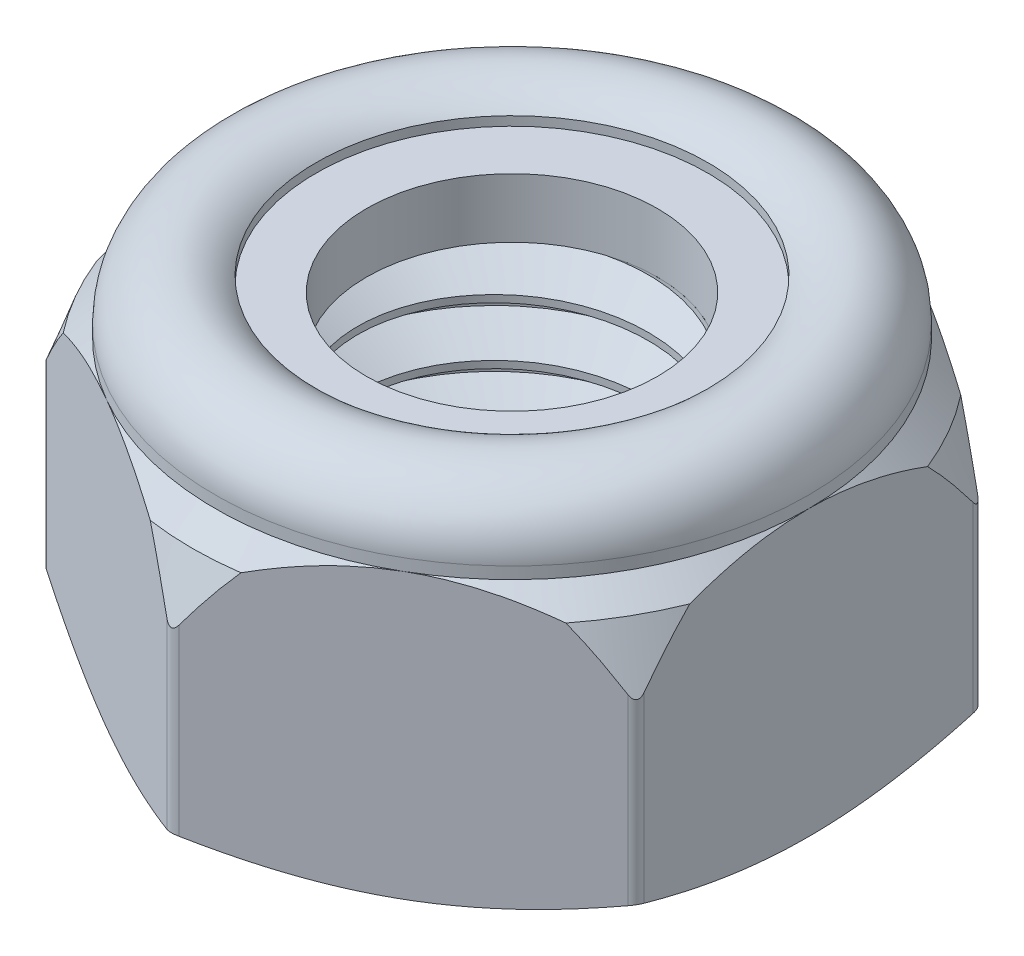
from build123d import *

# Parameters (mm, degrees)
BOSS_EXTRUDE1_DEPTH      = 4
BOSS_EXTRUDE1_DEPTH_BACK = 4
SKETCH2_R                = 3.188101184
FILLET1_R                = 0.26
SKETCH4_W                = 2.018521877
SKETCH4_H                = 1.301178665
SKETCH6_W                = 4
SKETCH6_H                = 6.447947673
CUT_SWEEP1_PITCH         = 1.25
CUT_SWEEP1_HEIGHT        = 8
CUT_SWEEP1_RADIUS        = 4
CUT_SWEEP1_START_ANGLE   = 90
SKETCH10_R               = 3.988101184
BOSS_EXTRUDE2_DEPTH      = 6


with BuildPart() as part:
    # Sketch2 → Boss-Extrude1 (new, two sides: drawn at the far end of the back side and taken through both)
    with BuildSketch(Plane(origin=(0, 0, 0), x_dir=(1, 0, 0), z_dir=(0, 1, 0)).offset(-BOSS_EXTRUDE1_DEPTH_BACK)):
        Polygon((0, 7.505553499), (-6.5, 3.75277675), (-6.5, -3.75277675), (0, -7.505553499), (6.5, -3.75277675), (6.5, 3.75277675), align=None)
        with Locations(Location((0, 0, 0), (0, 0, 270))):
            Circle(SKETCH2_R, mode=Mode.SUBTRACT)
    extrude(amount=BOSS_EXTRUDE1_DEPTH + BOSS_EXTRUDE1_DEPTH_BACK)

    # Sketch3 → Cut-Revolve2 (revolve, cut)
    with BuildSketch(Plane(origin=(0, 0, 0), x_dir=(0, 0, -1), z_dir=(1, 0, 0)), mode=Mode.PRIVATE) as cut_revolve2_sk:
        with BuildLine():
            Line((7.505553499, 2.447947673), (7.505553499, 5.552052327))
            Line((7.505553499, 5.552052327), (3.188101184, 5.552052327))
            Line((3.188101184, 5.552052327), (3.188101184, 2))
            Line((3.188101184, 2), (4.292067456, 2))
            Line((4.292067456, 2), (5.206623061, 2))
            Line((5.206623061, 2), (5.206623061, 3.421178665))
            Line((5.206623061, 3.421178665), (4.292067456, 3.421178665))
            Line((4.292067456, 3.421178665), (4.292067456, 3.621178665))
            ThreePointArc((4.292067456, 3.621178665), (5.701576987, 3.901547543), (6.5, 2.706623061))
            Line((6.5, 2.706623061), (6.5, 2.447947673))
            Line((6.5, 2.447947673), (7.505553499, 1.442394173))
            Line((7.505553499, 1.442394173), (7.505553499, 2.447947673))
        make_face()
        Polygon((6.11, -4), (7.505553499, -3.194276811), (7.505553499, -4), align=None)
        Polygon((3.188101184, -4), (3.188101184, -3.2), (3.988101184, -4), align=None)
    revolve(cut_revolve2_sk.sketch.rotate(Axis((0, -4, 0), (0, 1, 0)), 270), axis=Axis((0, -4, 0), (0, 1, 0)), mode=Mode.SUBTRACT)

    # Sketch11 → Cut-Revolve3 (revolve, cut)
    with BuildSketch(Plane(origin=(0, 0, 0), x_dir=(0, 0, -1), z_dir=(1, 0, 0)), mode=Mode.PRIVATE) as cut_revolve3_sk:
        Polygon((7.505553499, 0.563803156), (7.505553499, 1.945170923), (7.00277675, 1.945170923), align=None)
    revolve(cut_revolve3_sk.sketch.rotate(Axis((0, -4, 0), (0, 1, 0)), 270), axis=Axis((0, -4, 0), (0, 1, 0)), mode=Mode.SUBTRACT)

    # Fillet1
    fillet1_edges = [part.edges().sort_by_distance(p)[0] for p in [
        (-6.5, -1.315236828, -3.75277675),
        (0, -1.315236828, -7.505553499),
        (-6.5, -1.315236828, 3.75277675),
        (6.5, -1.315236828, -3.75277675),
        (6.5, -1.315236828, 3.75277675),
        (0, -1.315236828, 7.505553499),
    ]]
    fillet(fillet1_edges, radius=FILLET1_R)

    # Sketch10 → Boss-Extrude2 (add)
    with BuildSketch(Plane.XZ.offset(4)):
        Circle(SKETCH10_R)
    extrude(amount=-BOSS_EXTRUDE2_DEPTH)


with BuildPart() as body_2:
    # Sketch4 → Revolve1 (revolve)
    with BuildSketch(Plane(origin=(0, 0, 0), x_dir=(0, 0, -1), z_dir=(1, 0, 0)), mode=Mode.PRIVATE) as revolve1_sk:
        with Locations((4.197362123, 2.650589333)):
            Rectangle(SKETCH4_W, SKETCH4_H)
    revolve(revolve1_sk.sketch.rotate(Axis((0, -4, 0), (0, 1, 0)), 270), axis=Axis((0, -4, 0), (0, 1, 0)))


with BuildPart() as body_3:
    # Sketch6 → Revolve2 (revolve)
    with BuildSketch(Plane.XY, mode=Mode.PRIVATE) as revolve2_sk:
        with Locations((2, -0.776026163)):
            Rectangle(SKETCH6_W, SKETCH6_H)
    revolve(revolve2_sk.sketch.rotate(Axis((0, -4, 0), (0, 1, 0)), 90), axis=Axis((0, -4, 0), (0, 1, 0)))

    # Cut-Sweep1: sweep along a helix
    with BuildLine() as cut_sweep1_path:
        add(Helix(CUT_SWEEP1_PITCH, CUT_SWEEP1_HEIGHT, CUT_SWEEP1_RADIUS, center=(0, -4, 0), direction=(0, 1, 0), mode=Mode.PRIVATE).rotate(Axis((0, -4, 0), (0, 1, 0)), CUT_SWEEP1_START_ANGLE))
    # Sketch8 → Cut-Sweep1 (sweep, cut)
    with BuildSketch(Plane.XY):
        Polygon((3.188101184, -4.46875), (3.188101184, -4.625), (4.067658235, -5.1328125), (4.135316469, -3.921875), align=None)
    sweep(path=cut_sweep1_path.line, is_frenet=True, mode=Mode.SUBTRACT)

    # Sketch9 → Revolve3 (revolve)
    with BuildSketch(Plane.XY, mode=Mode.PRIVATE) as revolve3_sk:
        Polygon((0, 0), (0, -4), (4, -4), (4.8, -4), (0, 0.8), align=None)
    revolve(revolve3_sk.sketch.rotate(Axis((0, 0, 0), (0, -1, 0)), 151.002313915), axis=Axis((0, 0, 0), (0, -1, 0)))


with BuildPart() as part_1:
    add(part.part)

    # Combine1: cut body 3
    add(body_3.part, mode=Mode.SUBTRACT)


solid = Compound([body_2.part, part_1.part])
